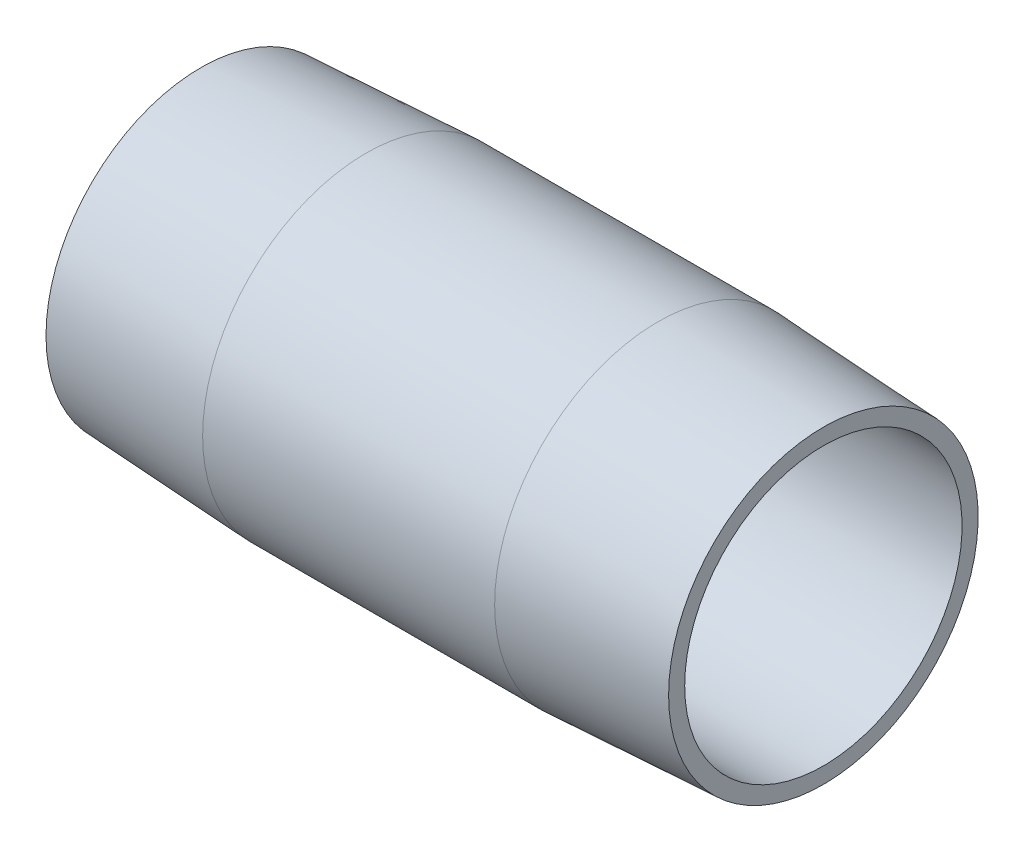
ISO-10303-21;
HEADER;
FILE_DESCRIPTION(('STEP AP214'),'2;1');
FILE_NAME('part.step','',(''),(''),'','','');
FILE_SCHEMA(('AUTOMOTIVE_DESIGN { 1 0 10303 214 1 1 1 1 }'));
ENDSEC;
DATA;
#1=APPLICATION_CONTEXT('core data for automotive mechanical design processes');
#2=APPLICATION_PROTOCOL_DEFINITION('international standard','automotive_design',2000,#1);
#3=PRODUCT_CONTEXT('',#1,'mechanical');
#4=PRODUCT('Part','Part','',(#3));
#5=PRODUCT_RELATED_PRODUCT_CATEGORY('part','',(#4));
#6=PRODUCT_DEFINITION_FORMATION('','',#4);
#7=PRODUCT_DEFINITION_CONTEXT('part definition',#1,'design');
#8=PRODUCT_DEFINITION('design','',#6,#7);
#9=PRODUCT_DEFINITION_SHAPE('','',#8);
#10=(LENGTH_UNIT() NAMED_UNIT(*) SI_UNIT(.MILLI.,.METRE.));
#11=(NAMED_UNIT(*) PLANE_ANGLE_UNIT() SI_UNIT($,.RADIAN.));
#12=(NAMED_UNIT(*) SI_UNIT($,.STERADIAN.) SOLID_ANGLE_UNIT());
#13=UNCERTAINTY_MEASURE_WITH_UNIT(LENGTH_MEASURE(1.E-05),#10,'distance_accuracy_value','');
#14=(GEOMETRIC_REPRESENTATION_CONTEXT(3) GLOBAL_UNCERTAINTY_ASSIGNED_CONTEXT((#13)) GLOBAL_UNIT_ASSIGNED_CONTEXT((#10,
#11,#12)) REPRESENTATION_CONTEXT('',''));
#15=CARTESIAN_POINT('',(0.,0.,0.));
#16=DIRECTION('',(0.,0.,1.));
#17=DIRECTION('',(1.,0.,0.));
#18=AXIS2_PLACEMENT_3D('',#15,#16,#17);
#19=CARTESIAN_POINT('',(50.8,0.,-11.3156739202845));
#20=DIRECTION('',(-1.,0.,0.));
#21=DIRECTION('',(0.,0.,1.));
#22=AXIS2_PLACEMENT_3D('',#19,#20,#21);
#23=PLANE('',#22);
#24=CARTESIAN_POINT('',(50.8,0.,0.));
#25=DIRECTION('',(-1.,0.,0.));
#26=DIRECTION('',(0.,0.,1.));
#27=AXIS2_PLACEMENT_3D('',#24,#25,#26);
#28=CIRCLE('',#27,12.6281292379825);
#29=CARTESIAN_POINT('',(50.8,0.,12.6281292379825));
#30=VERTEX_POINT('',#29);
#31=EDGE_CURVE('E10',#30,#30,#28,.T.);
#32=ORIENTED_EDGE('',*,*,#31,.F.);
#33=EDGE_LOOP('',(#32));
#34=FACE_BOUND('',#33,.T.);
#35=CARTESIAN_POINT('',(50.8,0.,0.));
#36=DIRECTION('',(-1.,0.,0.));
#37=DIRECTION('',(0.,0.,1.));
#38=AXIS2_PLACEMENT_3D('',#35,#36,#37);
#39=CIRCLE('',#38,11.3156739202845);
#40=CARTESIAN_POINT('',(50.8,0.,11.3156739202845));
#41=VERTEX_POINT('',#40);
#42=EDGE_CURVE('E52',#41,#41,#39,.T.);
#43=ORIENTED_EDGE('',*,*,#42,.T.);
#44=EDGE_LOOP('',(#43));
#45=FACE_BOUND('',#44,.T.);
#46=ADVANCED_FACE('F30',(#34,#45),#23,.F.);
#47=CARTESIAN_POINT('',(50.8,0.,0.));
#48=DIRECTION('',(-1.,0.,0.));
#49=DIRECTION('',(0.,0.,1.));
#50=AXIS2_PLACEMENT_3D('',#47,#48,#49);
#51=CONICAL_SURFACE('',#50,12.6281292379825,0.0523598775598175);
#52=CARTESIAN_POINT('',(37.3126,0.,0.));
#53=DIRECTION('',(-1.,0.,0.));
#54=DIRECTION('',(0.,0.,1.));
#55=AXIS2_PLACEMENT_3D('',#52,#53,#54);
#56=CIRCLE('',#55,13.3349739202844);
#57=CARTESIAN_POINT('',(37.3126,0.,13.3349739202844));
#58=VERTEX_POINT('',#57);
#59=EDGE_CURVE('E36',#58,#58,#56,.T.);
#60=ORIENTED_EDGE('',*,*,#59,.F.);
#61=EDGE_LOOP('',(#60));
#62=FACE_BOUND('',#61,.T.);
#63=ORIENTED_EDGE('',*,*,#31,.T.);
#64=EDGE_LOOP('',(#63));
#65=FACE_BOUND('',#64,.T.);
#66=ADVANCED_FACE('F77',(#62,#65),#51,.T.);
#67=CARTESIAN_POINT('',(0.,0.,0.));
#68=DIRECTION('',(-1.,0.,0.));
#69=DIRECTION('',(0.,0.,1.));
#70=AXIS2_PLACEMENT_3D('',#67,#68,#69);
#71=CYLINDRICAL_SURFACE('',#70,13.3349739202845);
#72=CARTESIAN_POINT('',(13.4874,0.,0.));
#73=DIRECTION('',(-1.,0.,0.));
#74=DIRECTION('',(0.,0.,1.));
#75=AXIS2_PLACEMENT_3D('',#72,#73,#74);
#76=CIRCLE('',#75,13.3349739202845);
#77=CARTESIAN_POINT('',(13.4874,0.,13.3349739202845));
#78=VERTEX_POINT('',#77);
#79=EDGE_CURVE('E40',#78,#78,#76,.T.);
#80=ORIENTED_EDGE('',*,*,#79,.F.);
#81=EDGE_LOOP('',(#80));
#82=FACE_BOUND('',#81,.T.);
#83=ORIENTED_EDGE('',*,*,#59,.T.);
#84=EDGE_LOOP('',(#83));
#85=FACE_BOUND('',#84,.T.);
#86=ADVANCED_FACE('F72',(#82,#85),#71,.T.);
#87=CARTESIAN_POINT('',(13.4874,0.,0.));
#88=DIRECTION('',(1.,0.,0.));
#89=DIRECTION('',(0.,0.,-1.));
#90=AXIS2_PLACEMENT_3D('',#87,#88,#89);
#91=CONICAL_SURFACE('',#90,13.3349739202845,0.0523598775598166);
#92=CARTESIAN_POINT('',(0.,0.,0.));
#93=DIRECTION('',(-1.,0.,0.));
#94=DIRECTION('',(0.,0.,1.));
#95=AXIS2_PLACEMENT_3D('',#92,#93,#94);
#96=CIRCLE('',#95,12.6281292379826);
#97=CARTESIAN_POINT('',(0.,0.,12.6281292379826));
#98=VERTEX_POINT('',#97);
#99=EDGE_CURVE('E44',#98,#98,#96,.T.);
#100=ORIENTED_EDGE('',*,*,#99,.F.);
#101=EDGE_LOOP('',(#100));
#102=FACE_BOUND('',#101,.T.);
#103=ORIENTED_EDGE('',*,*,#79,.T.);
#104=EDGE_LOOP('',(#103));
#105=FACE_BOUND('',#104,.T.);
#106=ADVANCED_FACE('F66',(#102,#105),#91,.T.);
#107=CARTESIAN_POINT('',(0.,0.,-11.3156739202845));
#108=DIRECTION('',(1.,0.,0.));
#109=DIRECTION('',(0.,0.,-1.));
#110=AXIS2_PLACEMENT_3D('',#107,#108,#109);
#111=PLANE('',#110);
#112=CARTESIAN_POINT('',(0.,0.,0.));
#113=DIRECTION('',(-1.,0.,0.));
#114=DIRECTION('',(0.,0.,1.));
#115=AXIS2_PLACEMENT_3D('',#112,#113,#114);
#116=CIRCLE('',#115,11.3156739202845);
#117=CARTESIAN_POINT('',(0.,0.,11.3156739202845));
#118=VERTEX_POINT('',#117);
#119=EDGE_CURVE('E49',#118,#118,#116,.T.);
#120=ORIENTED_EDGE('',*,*,#119,.F.);
#121=EDGE_LOOP('',(#120));
#122=FACE_BOUND('',#121,.T.);
#123=ORIENTED_EDGE('',*,*,#99,.T.);
#124=EDGE_LOOP('',(#123));
#125=FACE_BOUND('',#124,.T.);
#126=ADVANCED_FACE('F60',(#122,#125),#111,.F.);
#127=CARTESIAN_POINT('',(0.,0.,0.));
#128=DIRECTION('',(-1.,0.,0.));
#129=DIRECTION('',(0.,0.,1.));
#130=AXIS2_PLACEMENT_3D('',#127,#128,#129);
#131=CYLINDRICAL_SURFACE('',#130,11.3156739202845);
#132=ORIENTED_EDGE('',*,*,#42,.F.);
#133=EDGE_LOOP('',(#132));
#134=FACE_BOUND('',#133,.T.);
#135=ORIENTED_EDGE('',*,*,#119,.T.);
#136=EDGE_LOOP('',(#135));
#137=FACE_BOUND('',#136,.T.);
#138=ADVANCED_FACE('F57',(#134,#137),#131,.F.);
#139=CLOSED_SHELL('',(#46,#66,#86,#106,#126,#138));
#140=MANIFOLD_SOLID_BREP('B2',#139);
#141=ADVANCED_BREP_SHAPE_REPRESENTATION('',(#18,#140),#14);
#142=SHAPE_DEFINITION_REPRESENTATION(#9,#141);
ENDSEC;
END-ISO-10303-21;
